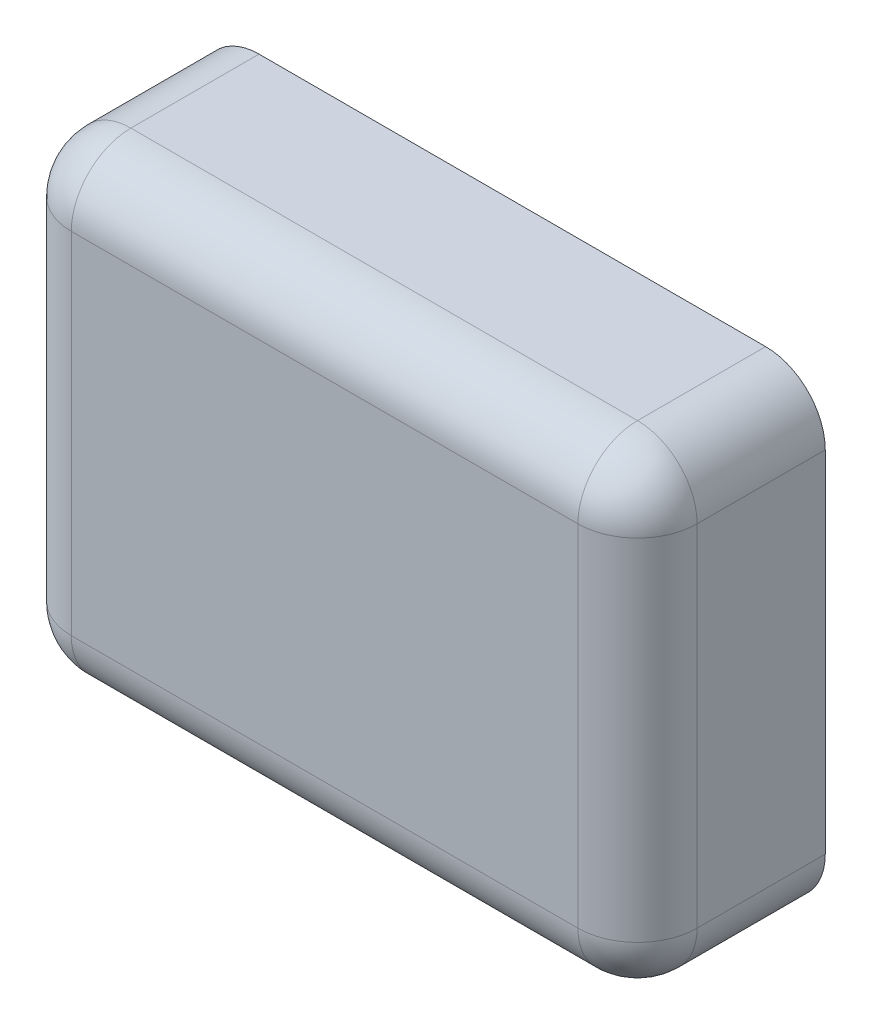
from build123d import *

# Parameters (mm, degrees)
SKETCH1_W      = 200
SKETCH1_H      = 150
EXTRUDE1_DEPTH = 60
FILLET1_R      = 19.05


with BuildPart() as part:
    # Sketch1 → Extrude1 (new body)
    with BuildSketch(Plane.XY):
        with Locations((100, -75)):
            Rectangle(SKETCH1_W, SKETCH1_H)
    extrude(amount=EXTRUDE1_DEPTH)

    # Fillet1
    fillet1_edges = [part.edges().sort_by_distance(p)[0] for p in [
        (0, 0, 30),
        (200, 0, 30),
        (100, 0, 60),
        (200, -150, 30),
        (200, -75, 60),
        (0, -150, 30),
        (100, -150, 60),
        (0, -75, 60),
    ]]
    fillet(fillet1_edges, radius=FILLET1_R)


solid = part.part
